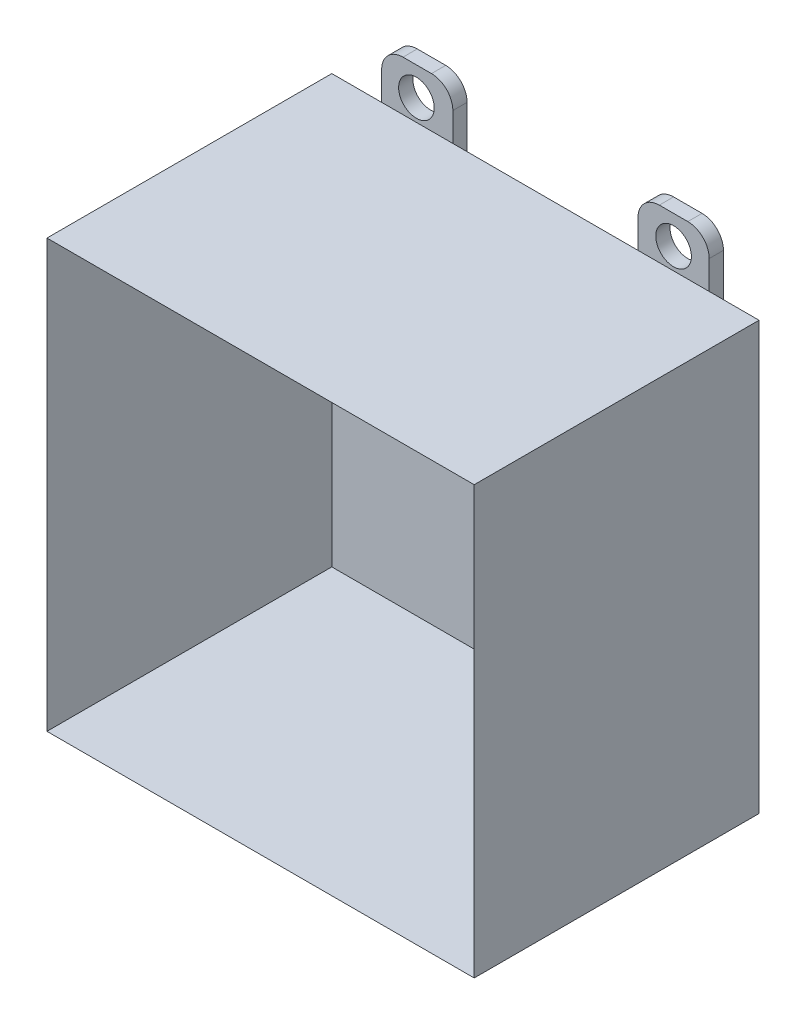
ISO-10303-21;
HEADER;
FILE_DESCRIPTION(('STEP AP214'),'2;1');
FILE_NAME('part.step','',(''),(''),'','','');
FILE_SCHEMA(('AUTOMOTIVE_DESIGN { 1 0 10303 214 1 1 1 1 }'));
ENDSEC;
DATA;
#1=APPLICATION_CONTEXT('core data for automotive mechanical design processes');
#2=APPLICATION_PROTOCOL_DEFINITION('international standard','automotive_design',2000,#1);
#3=PRODUCT_CONTEXT('',#1,'mechanical');
#4=PRODUCT('Part','Part','',(#3));
#5=PRODUCT_RELATED_PRODUCT_CATEGORY('part','',(#4));
#6=PRODUCT_DEFINITION_FORMATION('','',#4);
#7=PRODUCT_DEFINITION_CONTEXT('part definition',#1,'design');
#8=PRODUCT_DEFINITION('design','',#6,#7);
#9=PRODUCT_DEFINITION_SHAPE('','',#8);
#10=(LENGTH_UNIT() NAMED_UNIT(*) SI_UNIT(.MILLI.,.METRE.));
#11=(NAMED_UNIT(*) PLANE_ANGLE_UNIT() SI_UNIT($,.RADIAN.));
#12=(NAMED_UNIT(*) SI_UNIT($,.STERADIAN.) SOLID_ANGLE_UNIT());
#13=UNCERTAINTY_MEASURE_WITH_UNIT(LENGTH_MEASURE(1.E-05),#10,'distance_accuracy_value','');
#14=(GEOMETRIC_REPRESENTATION_CONTEXT(3) GLOBAL_UNCERTAINTY_ASSIGNED_CONTEXT((#13)) GLOBAL_UNIT_ASSIGNED_CONTEXT((#10,
#11,#12)) REPRESENTATION_CONTEXT('',''));
#15=CARTESIAN_POINT('',(0.,0.,0.));
#16=DIRECTION('',(0.,0.,1.));
#17=DIRECTION('',(1.,0.,0.));
#18=AXIS2_PLACEMENT_3D('',#15,#16,#17);
#19=CARTESIAN_POINT('',(-29.21,29.21,-2.54));
#20=DIRECTION('',(1.,0.,0.));
#21=DIRECTION('',(0.,0.,-1.));
#22=AXIS2_PLACEMENT_3D('',#19,#20,#21);
#23=PLANE('',#22);
#24=DIRECTION('',(0.,1.,0.));
#25=VECTOR('',#24,1.);
#26=CARTESIAN_POINT('',(-29.21,29.21,0.));
#27=LINE('',#26,#25);
#28=CARTESIAN_POINT('',(-29.21,29.21,0.));
#29=VERTEX_POINT('',#28);
#30=CARTESIAN_POINT('',(-29.21,43.18,0.));
#31=VERTEX_POINT('',#30);
#32=EDGE_CURVE('E132',#29,#31,#27,.T.);
#33=ORIENTED_EDGE('',*,*,#32,.T.);
#34=DIRECTION('',(0.,0.,1.));
#35=VECTOR('',#34,1.);
#36=CARTESIAN_POINT('',(-29.21,43.18,-2.54));
#37=LINE('',#36,#35);
#38=CARTESIAN_POINT('',(-29.21,43.18,-2.54));
#39=VERTEX_POINT('',#38);
#40=EDGE_CURVE('E76',#31,#39,#37,.F.);
#41=ORIENTED_EDGE('',*,*,#40,.T.);
#42=DIRECTION('',(0.,1.,0.));
#43=VECTOR('',#42,1.);
#44=CARTESIAN_POINT('',(-29.21,29.21,-2.54));
#45=LINE('',#44,#43);
#46=CARTESIAN_POINT('',(-29.21,29.21,-2.54));
#47=VERTEX_POINT('',#46);
#48=EDGE_CURVE('E140',#47,#39,#45,.T.);
#49=ORIENTED_EDGE('',*,*,#48,.F.);
#50=DIRECTION('',(0.,0.,1.));
#51=VECTOR('',#50,1.);
#52=CARTESIAN_POINT('',(-29.21,29.21,-2.54));
#53=LINE('',#52,#51);
#54=EDGE_CURVE('E124',#47,#29,#53,.T.);
#55=ORIENTED_EDGE('',*,*,#54,.T.);
#56=EDGE_LOOP('',(#33,#41,#49,#55));
#57=FACE_BOUND('',#56,.T.);
#58=ADVANCED_FACE('F53',(#57),#23,.F.);
#59=CARTESIAN_POINT('',(-16.51,46.99,-2.54));
#60=DIRECTION('',(0.,-1.,0.));
#61=DIRECTION('',(0.,0.,-1.));
#62=AXIS2_PLACEMENT_3D('',#59,#60,#61);
#63=PLANE('',#62);
#64=DIRECTION('',(1.,0.,0.));
#65=VECTOR('',#64,1.);
#66=CARTESIAN_POINT('',(-16.51,46.99,-2.54));
#67=LINE('',#66,#65);
#68=CARTESIAN_POINT('',(-25.4,46.99,-2.54));
#69=VERTEX_POINT('',#68);
#70=CARTESIAN_POINT('',(-20.32,46.99,-2.54));
#71=VERTEX_POINT('',#70);
#72=EDGE_CURVE('E114',#69,#71,#67,.T.);
#73=ORIENTED_EDGE('',*,*,#72,.F.);
#74=DIRECTION('',(0.,0.,1.));
#75=VECTOR('',#74,1.);
#76=CARTESIAN_POINT('',(-25.4,46.99,-2.54));
#77=LINE('',#76,#75);
#78=CARTESIAN_POINT('',(-25.4,46.99,0.));
#79=VERTEX_POINT('',#78);
#80=EDGE_CURVE('E143',#69,#79,#77,.T.);
#81=ORIENTED_EDGE('',*,*,#80,.T.);
#82=DIRECTION('',(1.,0.,0.));
#83=VECTOR('',#82,1.);
#84=CARTESIAN_POINT('',(-16.51,46.99,0.));
#85=LINE('',#84,#83);
#86=CARTESIAN_POINT('',(-20.32,46.99,0.));
#87=VERTEX_POINT('',#86);
#88=EDGE_CURVE('E134',#79,#87,#85,.T.);
#89=ORIENTED_EDGE('',*,*,#88,.T.);
#90=DIRECTION('',(0.,0.,1.));
#91=VECTOR('',#90,1.);
#92=CARTESIAN_POINT('',(-20.32,46.99,-2.54));
#93=LINE('',#92,#91);
#94=EDGE_CURVE('E123',#87,#71,#93,.F.);
#95=ORIENTED_EDGE('',*,*,#94,.T.);
#96=EDGE_LOOP('',(#73,#81,#89,#95));
#97=FACE_BOUND('',#96,.T.);
#98=ADVANCED_FACE('F156',(#97),#63,.F.);
#99=CARTESIAN_POINT('',(-16.51,29.21,-2.54));
#100=DIRECTION('',(-1.,0.,0.));
#101=DIRECTION('',(0.,0.,1.));
#102=AXIS2_PLACEMENT_3D('',#99,#100,#101);
#103=PLANE('',#102);
#104=DIRECTION('',(0.,-1.,0.));
#105=VECTOR('',#104,1.);
#106=CARTESIAN_POINT('',(-16.51,29.21,-2.54));
#107=LINE('',#106,#105);
#108=CARTESIAN_POINT('',(-16.51,43.18,-2.54));
#109=VERTEX_POINT('',#108);
#110=CARTESIAN_POINT('',(-16.51,29.21,-2.54));
#111=VERTEX_POINT('',#110);
#112=EDGE_CURVE('E106',#109,#111,#107,.T.);
#113=ORIENTED_EDGE('',*,*,#112,.F.);
#114=DIRECTION('',(0.,0.,1.));
#115=VECTOR('',#114,1.);
#116=CARTESIAN_POINT('',(-16.51,43.18,-2.54));
#117=LINE('',#116,#115);
#118=CARTESIAN_POINT('',(-16.51,43.18,0.));
#119=VERTEX_POINT('',#118);
#120=EDGE_CURVE('E12',#109,#119,#117,.T.);
#121=ORIENTED_EDGE('',*,*,#120,.T.);
#122=DIRECTION('',(0.,-1.,0.));
#123=VECTOR('',#122,1.);
#124=CARTESIAN_POINT('',(-16.51,29.21,0.));
#125=LINE('',#124,#123);
#126=CARTESIAN_POINT('',(-16.51,29.21,0.));
#127=VERTEX_POINT('',#126);
#128=EDGE_CURVE('E120',#119,#127,#125,.T.);
#129=ORIENTED_EDGE('',*,*,#128,.T.);
#130=DIRECTION('',(0.,0.,1.));
#131=VECTOR('',#130,1.);
#132=CARTESIAN_POINT('',(-16.51,29.21,-2.54));
#133=LINE('',#132,#131);
#134=EDGE_CURVE('E117',#111,#127,#133,.T.);
#135=ORIENTED_EDGE('',*,*,#134,.F.);
#136=EDGE_LOOP('',(#113,#121,#129,#135));
#137=FACE_BOUND('',#136,.T.);
#138=ADVANCED_FACE('F118',(#137),#103,.F.);
#139=CARTESIAN_POINT('',(-16.51,29.21,-2.54));
#140=DIRECTION('',(0.,1.,0.));
#141=DIRECTION('',(0.,0.,1.));
#142=AXIS2_PLACEMENT_3D('',#139,#140,#141);
#143=PLANE('',#142);
#144=DIRECTION('',(-1.,0.,0.));
#145=VECTOR('',#144,1.);
#146=CARTESIAN_POINT('',(-16.51,29.21,0.));
#147=LINE('',#146,#145);
#148=EDGE_CURVE('E139',#127,#29,#147,.T.);
#149=ORIENTED_EDGE('',*,*,#148,.T.);
#150=ORIENTED_EDGE('',*,*,#54,.F.);
#151=DIRECTION('',(-1.,0.,0.));
#152=VECTOR('',#151,1.);
#153=CARTESIAN_POINT('',(-16.51,29.21,-2.54));
#154=LINE('',#153,#152);
#155=EDGE_CURVE('E110',#111,#47,#154,.T.);
#156=ORIENTED_EDGE('',*,*,#155,.F.);
#157=ORIENTED_EDGE('',*,*,#134,.T.);
#158=EDGE_LOOP('',(#149,#150,#156,#157));
#159=FACE_BOUND('',#158,.T.);
#160=ADVANCED_FACE('F126',(#159),#143,.F.);
#161=CARTESIAN_POINT('',(0.,0.,-2.54));
#162=DIRECTION('',(0.,0.,1.));
#163=DIRECTION('',(1.,0.,0.));
#164=AXIS2_PLACEMENT_3D('',#161,#162,#163);
#165=PLANE('',#164);
#166=CARTESIAN_POINT('',(-23.0080853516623,41.91,-2.54));
#167=DIRECTION('',(0.,0.,1.));
#168=DIRECTION('',(1.,0.,0.));
#169=AXIS2_PLACEMENT_3D('',#166,#167,#168);
#170=CIRCLE('',#169,3.175);
#171=CARTESIAN_POINT('',(-19.8330853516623,41.91,-2.54));
#172=VERTEX_POINT('',#171);
#173=EDGE_CURVE('E135',#172,#172,#170,.T.);
#174=ORIENTED_EDGE('',*,*,#173,.T.);
#175=EDGE_LOOP('',(#174));
#176=FACE_BOUND('',#175,.T.);
#177=ORIENTED_EDGE('',*,*,#48,.T.);
#178=CARTESIAN_POINT('',(-25.4,43.18,-2.54));
#179=DIRECTION('',(0.,0.,1.));
#180=DIRECTION('',(1.,0.,0.));
#181=AXIS2_PLACEMENT_3D('',#178,#179,#180);
#182=CIRCLE('',#181,3.81);
#183=EDGE_CURVE('E61',#39,#69,#182,.F.);
#184=ORIENTED_EDGE('',*,*,#183,.T.);
#185=ORIENTED_EDGE('',*,*,#72,.T.);
#186=CARTESIAN_POINT('',(-20.32,43.18,-2.54));
#187=DIRECTION('',(0.,0.,1.));
#188=DIRECTION('',(1.,0.,0.));
#189=AXIS2_PLACEMENT_3D('',#186,#187,#188);
#190=CIRCLE('',#189,3.81);
#191=EDGE_CURVE('E68',#71,#109,#190,.F.);
#192=ORIENTED_EDGE('',*,*,#191,.T.);
#193=ORIENTED_EDGE('',*,*,#112,.T.);
#194=ORIENTED_EDGE('',*,*,#155,.T.);
#195=EDGE_LOOP('',(#177,#184,#185,#192,#193,#194));
#196=FACE_BOUND('',#195,.T.);
#197=ADVANCED_FACE('F108',(#176,#196),#165,.F.);
#198=CARTESIAN_POINT('',(0.,0.,0.));
#199=DIRECTION('',(0.,0.,1.));
#200=DIRECTION('',(1.,0.,0.));
#201=AXIS2_PLACEMENT_3D('',#198,#199,#200);
#202=PLANE('',#201);
#203=CARTESIAN_POINT('',(-23.0080853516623,41.91,0.));
#204=DIRECTION('',(0.,0.,1.));
#205=DIRECTION('',(1.,0.,0.));
#206=AXIS2_PLACEMENT_3D('',#203,#204,#205);
#207=CIRCLE('',#206,3.175);
#208=CARTESIAN_POINT('',(-19.8330853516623,41.91,0.));
#209=VERTEX_POINT('',#208);
#210=EDGE_CURVE('E165',#209,#209,#207,.T.);
#211=ORIENTED_EDGE('',*,*,#210,.F.);
#212=EDGE_LOOP('',(#211));
#213=FACE_BOUND('',#212,.T.);
#214=ORIENTED_EDGE('',*,*,#88,.F.);
#215=CARTESIAN_POINT('',(-25.4,43.18,0.));
#216=DIRECTION('',(0.,0.,1.));
#217=DIRECTION('',(1.,0.,0.));
#218=AXIS2_PLACEMENT_3D('',#215,#216,#217);
#219=CIRCLE('',#218,3.81);
#220=EDGE_CURVE('E148',#79,#31,#219,.T.);
#221=ORIENTED_EDGE('',*,*,#220,.T.);
#222=ORIENTED_EDGE('',*,*,#32,.F.);
#223=ORIENTED_EDGE('',*,*,#148,.F.);
#224=ORIENTED_EDGE('',*,*,#128,.F.);
#225=CARTESIAN_POINT('',(-20.32,43.18,0.));
#226=DIRECTION('',(0.,0.,1.));
#227=DIRECTION('',(1.,0.,0.));
#228=AXIS2_PLACEMENT_3D('',#225,#226,#227);
#229=CIRCLE('',#228,3.81);
#230=EDGE_CURVE('E146',#119,#87,#229,.T.);
#231=ORIENTED_EDGE('',*,*,#230,.T.);
#232=EDGE_LOOP('',(#214,#221,#222,#223,#224,#231));
#233=FACE_BOUND('',#232,.T.);
#234=ADVANCED_FACE('F162',(#213,#233),#202,.T.);
#235=CARTESIAN_POINT('',(-23.0080853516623,41.91,-2.54));
#236=DIRECTION('',(0.,0.,1.));
#237=DIRECTION('',(1.,0.,0.));
#238=AXIS2_PLACEMENT_3D('',#235,#236,#237);
#239=CYLINDRICAL_SURFACE('',#238,3.175);
#240=ORIENTED_EDGE('',*,*,#173,.F.);
#241=EDGE_LOOP('',(#240));
#242=FACE_BOUND('',#241,.T.);
#243=ORIENTED_EDGE('',*,*,#210,.T.);
#244=EDGE_LOOP('',(#243));
#245=FACE_BOUND('',#244,.T.);
#246=ADVANCED_FACE('F172',(#242,#245),#239,.F.);
#247=CARTESIAN_POINT('',(-25.4,43.18,-2.54));
#248=DIRECTION('',(0.,0.,1.));
#249=DIRECTION('',(1.,0.,0.));
#250=AXIS2_PLACEMENT_3D('',#247,#248,#249);
#251=CYLINDRICAL_SURFACE('',#250,3.81);
#252=ORIENTED_EDGE('',*,*,#183,.F.);
#253=ORIENTED_EDGE('',*,*,#40,.F.);
#254=ORIENTED_EDGE('',*,*,#220,.F.);
#255=ORIENTED_EDGE('',*,*,#80,.F.);
#256=EDGE_LOOP('',(#252,#253,#254,#255));
#257=FACE_BOUND('',#256,.T.);
#258=ADVANCED_FACE('F159',(#257),#251,.T.);
#259=CARTESIAN_POINT('',(-20.32,43.18,-2.54));
#260=DIRECTION('',(0.,0.,1.));
#261=DIRECTION('',(1.,0.,0.));
#262=AXIS2_PLACEMENT_3D('',#259,#260,#261);
#263=CYLINDRICAL_SURFACE('',#262,3.81);
#264=ORIENTED_EDGE('',*,*,#191,.F.);
#265=ORIENTED_EDGE('',*,*,#94,.F.);
#266=ORIENTED_EDGE('',*,*,#230,.F.);
#267=ORIENTED_EDGE('',*,*,#120,.F.);
#268=EDGE_LOOP('',(#264,#265,#266,#267));
#269=FACE_BOUND('',#268,.T.);
#270=ADVANCED_FACE('F55',(#269),#263,.T.);
#271=CLOSED_SHELL('',(#58,#98,#138,#160,#197,#234,#246,#258,#270));
#272=MANIFOLD_SOLID_BREP('B2',#271);
#273=CARTESIAN_POINT('',(16.51,46.99,-2.54));
#274=DIRECTION('',(1.,0.,0.));
#275=DIRECTION('',(0.,1.,0.));
#276=AXIS2_PLACEMENT_3D('',#273,#274,#275);
#277=PLANE('',#276);
#278=DIRECTION('',(0.,1.,0.));
#279=VECTOR('',#278,1.);
#280=CARTESIAN_POINT('',(16.51,46.99,0.));
#281=LINE('',#280,#279);
#282=CARTESIAN_POINT('',(16.51,29.21,0.));
#283=VERTEX_POINT('',#282);
#284=CARTESIAN_POINT('',(16.51,43.18,0.));
#285=VERTEX_POINT('',#284);
#286=EDGE_CURVE('E337',#283,#285,#281,.T.);
#287=ORIENTED_EDGE('',*,*,#286,.T.);
#288=DIRECTION('',(0.,0.,1.));
#289=VECTOR('',#288,1.);
#290=CARTESIAN_POINT('',(16.51,43.18,-2.54));
#291=LINE('',#290,#289);
#292=CARTESIAN_POINT('',(16.51,43.18,-2.54));
#293=VERTEX_POINT('',#292);
#294=EDGE_CURVE('E281',#285,#293,#291,.F.);
#295=ORIENTED_EDGE('',*,*,#294,.T.);
#296=DIRECTION('',(0.,1.,0.));
#297=VECTOR('',#296,1.);
#298=CARTESIAN_POINT('',(16.51,46.99,-2.54));
#299=LINE('',#298,#297);
#300=CARTESIAN_POINT('',(16.51,29.21,-2.54));
#301=VERTEX_POINT('',#300);
#302=EDGE_CURVE('E345',#301,#293,#299,.T.);
#303=ORIENTED_EDGE('',*,*,#302,.F.);
#304=DIRECTION('',(0.,0.,1.));
#305=VECTOR('',#304,1.);
#306=CARTESIAN_POINT('',(16.51,29.21,-2.54));
#307=LINE('',#306,#305);
#308=EDGE_CURVE('E329',#301,#283,#307,.T.);
#309=ORIENTED_EDGE('',*,*,#308,.T.);
#310=EDGE_LOOP('',(#287,#295,#303,#309));
#311=FACE_BOUND('',#310,.T.);
#312=ADVANCED_FACE('F258',(#311),#277,.F.);
#313=CARTESIAN_POINT('',(29.21,46.99,-2.54));
#314=DIRECTION('',(0.,-1.,0.));
#315=DIRECTION('',(0.,0.,-1.));
#316=AXIS2_PLACEMENT_3D('',#313,#314,#315);
#317=PLANE('',#316);
#318=DIRECTION('',(1.,0.,0.));
#319=VECTOR('',#318,1.);
#320=CARTESIAN_POINT('',(29.21,46.99,-2.54));
#321=LINE('',#320,#319);
#322=CARTESIAN_POINT('',(20.32,46.99,-2.54));
#323=VERTEX_POINT('',#322);
#324=CARTESIAN_POINT('',(25.4,46.99,-2.54));
#325=VERTEX_POINT('',#324);
#326=EDGE_CURVE('E319',#323,#325,#321,.T.);
#327=ORIENTED_EDGE('',*,*,#326,.F.);
#328=DIRECTION('',(0.,0.,1.));
#329=VECTOR('',#328,1.);
#330=CARTESIAN_POINT('',(20.32,46.99,-2.54));
#331=LINE('',#330,#329);
#332=CARTESIAN_POINT('',(20.32,46.99,0.));
#333=VERTEX_POINT('',#332);
#334=EDGE_CURVE('E348',#323,#333,#331,.T.);
#335=ORIENTED_EDGE('',*,*,#334,.T.);
#336=DIRECTION('',(1.,0.,0.));
#337=VECTOR('',#336,1.);
#338=CARTESIAN_POINT('',(29.21,46.99,0.));
#339=LINE('',#338,#337);
#340=CARTESIAN_POINT('',(25.4,46.99,0.));
#341=VERTEX_POINT('',#340);
#342=EDGE_CURVE('E339',#333,#341,#339,.T.);
#343=ORIENTED_EDGE('',*,*,#342,.T.);
#344=DIRECTION('',(0.,0.,1.));
#345=VECTOR('',#344,1.);
#346=CARTESIAN_POINT('',(25.4,46.99,-2.54));
#347=LINE('',#346,#345);
#348=EDGE_CURVE('E328',#341,#325,#347,.F.);
#349=ORIENTED_EDGE('',*,*,#348,.T.);
#350=EDGE_LOOP('',(#327,#335,#343,#349));
#351=FACE_BOUND('',#350,.T.);
#352=ADVANCED_FACE('F361',(#351),#317,.F.);
#353=CARTESIAN_POINT('',(29.21,46.99,-2.54));
#354=DIRECTION('',(-1.,0.,0.));
#355=DIRECTION('',(0.,-1.,0.));
#356=AXIS2_PLACEMENT_3D('',#353,#354,#355);
#357=PLANE('',#356);
#358=DIRECTION('',(0.,-1.,0.));
#359=VECTOR('',#358,1.);
#360=CARTESIAN_POINT('',(29.21,46.99,-2.54));
#361=LINE('',#360,#359);
#362=CARTESIAN_POINT('',(29.21,43.18,-2.54));
#363=VERTEX_POINT('',#362);
#364=CARTESIAN_POINT('',(29.21,29.21,-2.54));
#365=VERTEX_POINT('',#364);
#366=EDGE_CURVE('E311',#363,#365,#361,.T.);
#367=ORIENTED_EDGE('',*,*,#366,.F.);
#368=DIRECTION('',(0.,0.,1.));
#369=VECTOR('',#368,1.);
#370=CARTESIAN_POINT('',(29.21,43.18,-2.54));
#371=LINE('',#370,#369);
#372=CARTESIAN_POINT('',(29.21,43.18,0.));
#373=VERTEX_POINT('',#372);
#374=EDGE_CURVE('E51',#363,#373,#371,.T.);
#375=ORIENTED_EDGE('',*,*,#374,.T.);
#376=DIRECTION('',(0.,-1.,0.));
#377=VECTOR('',#376,1.);
#378=CARTESIAN_POINT('',(29.21,46.99,0.));
#379=LINE('',#378,#377);
#380=CARTESIAN_POINT('',(29.21,29.21,0.));
#381=VERTEX_POINT('',#380);
#382=EDGE_CURVE('E325',#373,#381,#379,.T.);
#383=ORIENTED_EDGE('',*,*,#382,.T.);
#384=DIRECTION('',(0.,0.,1.));
#385=VECTOR('',#384,1.);
#386=CARTESIAN_POINT('',(29.21,29.21,-2.54));
#387=LINE('',#386,#385);
#388=EDGE_CURVE('E322',#365,#381,#387,.T.);
#389=ORIENTED_EDGE('',*,*,#388,.F.);
#390=EDGE_LOOP('',(#367,#375,#383,#389));
#391=FACE_BOUND('',#390,.T.);
#392=ADVANCED_FACE('F323',(#391),#357,.F.);
#393=CARTESIAN_POINT('',(29.21,29.21,-2.54));
#394=DIRECTION('',(0.,1.,0.));
#395=DIRECTION('',(0.,0.,1.));
#396=AXIS2_PLACEMENT_3D('',#393,#394,#395);
#397=PLANE('',#396);
#398=DIRECTION('',(-1.,0.,0.));
#399=VECTOR('',#398,1.);
#400=CARTESIAN_POINT('',(29.21,29.21,0.));
#401=LINE('',#400,#399);
#402=EDGE_CURVE('E344',#381,#283,#401,.T.);
#403=ORIENTED_EDGE('',*,*,#402,.T.);
#404=ORIENTED_EDGE('',*,*,#308,.F.);
#405=DIRECTION('',(-1.,0.,0.));
#406=VECTOR('',#405,1.);
#407=CARTESIAN_POINT('',(29.21,29.21,-2.54));
#408=LINE('',#407,#406);
#409=EDGE_CURVE('E315',#365,#301,#408,.T.);
#410=ORIENTED_EDGE('',*,*,#409,.F.);
#411=ORIENTED_EDGE('',*,*,#388,.T.);
#412=EDGE_LOOP('',(#403,#404,#410,#411));
#413=FACE_BOUND('',#412,.T.);
#414=ADVANCED_FACE('F331',(#413),#397,.F.);
#415=CARTESIAN_POINT('',(0.,0.,-2.54));
#416=DIRECTION('',(0.,0.,-1.));
#417=DIRECTION('',(-1.,0.,0.));
#418=AXIS2_PLACEMENT_3D('',#415,#416,#417);
#419=PLANE('',#418);
#420=CARTESIAN_POINT('',(22.86,41.91,-2.54));
#421=DIRECTION('',(0.,0.,1.));
#422=DIRECTION('',(1.,0.,0.));
#423=AXIS2_PLACEMENT_3D('',#420,#421,#422);
#424=CIRCLE('',#423,3.175);
#425=CARTESIAN_POINT('',(26.035,41.91,-2.54));
#426=VERTEX_POINT('',#425);
#427=EDGE_CURVE('E340',#426,#426,#424,.T.);
#428=ORIENTED_EDGE('',*,*,#427,.T.);
#429=EDGE_LOOP('',(#428));
#430=FACE_BOUND('',#429,.T.);
#431=ORIENTED_EDGE('',*,*,#302,.T.);
#432=CARTESIAN_POINT('',(20.32,43.18,-2.54));
#433=DIRECTION('',(0.,0.,-1.));
#434=DIRECTION('',(-1.,0.,0.));
#435=AXIS2_PLACEMENT_3D('',#432,#433,#434);
#436=CIRCLE('',#435,3.81);
#437=EDGE_CURVE('E266',#293,#323,#436,.T.);
#438=ORIENTED_EDGE('',*,*,#437,.T.);
#439=ORIENTED_EDGE('',*,*,#326,.T.);
#440=CARTESIAN_POINT('',(25.4,43.18,-2.54));
#441=DIRECTION('',(0.,0.,-1.));
#442=DIRECTION('',(-1.,0.,0.));
#443=AXIS2_PLACEMENT_3D('',#440,#441,#442);
#444=CIRCLE('',#443,3.81);
#445=EDGE_CURVE('E273',#325,#363,#444,.T.);
#446=ORIENTED_EDGE('',*,*,#445,.T.);
#447=ORIENTED_EDGE('',*,*,#366,.T.);
#448=ORIENTED_EDGE('',*,*,#409,.T.);
#449=EDGE_LOOP('',(#431,#438,#439,#446,#447,#448));
#450=FACE_BOUND('',#449,.T.);
#451=ADVANCED_FACE('F313',(#430,#450),#419,.T.);
#452=CARTESIAN_POINT('',(0.,0.,0.));
#453=DIRECTION('',(0.,0.,-1.));
#454=DIRECTION('',(-1.,0.,0.));
#455=AXIS2_PLACEMENT_3D('',#452,#453,#454);
#456=PLANE('',#455);
#457=CARTESIAN_POINT('',(22.86,41.91,0.));
#458=DIRECTION('',(0.,0.,1.));
#459=DIRECTION('',(1.,0.,0.));
#460=AXIS2_PLACEMENT_3D('',#457,#458,#459);
#461=CIRCLE('',#460,3.175);
#462=CARTESIAN_POINT('',(26.035,41.91,0.));
#463=VERTEX_POINT('',#462);
#464=EDGE_CURVE('E370',#463,#463,#461,.T.);
#465=ORIENTED_EDGE('',*,*,#464,.F.);
#466=EDGE_LOOP('',(#465));
#467=FACE_BOUND('',#466,.T.);
#468=ORIENTED_EDGE('',*,*,#342,.F.);
#469=CARTESIAN_POINT('',(20.32,43.18,0.));
#470=DIRECTION('',(0.,0.,-1.));
#471=DIRECTION('',(-1.,0.,0.));
#472=AXIS2_PLACEMENT_3D('',#469,#470,#471);
#473=CIRCLE('',#472,3.81);
#474=EDGE_CURVE('E353',#333,#285,#473,.F.);
#475=ORIENTED_EDGE('',*,*,#474,.T.);
#476=ORIENTED_EDGE('',*,*,#286,.F.);
#477=ORIENTED_EDGE('',*,*,#402,.F.);
#478=ORIENTED_EDGE('',*,*,#382,.F.);
#479=CARTESIAN_POINT('',(25.4,43.18,0.));
#480=DIRECTION('',(0.,0.,-1.));
#481=DIRECTION('',(-1.,0.,0.));
#482=AXIS2_PLACEMENT_3D('',#479,#480,#481);
#483=CIRCLE('',#482,3.81);
#484=EDGE_CURVE('E351',#373,#341,#483,.F.);
#485=ORIENTED_EDGE('',*,*,#484,.T.);
#486=EDGE_LOOP('',(#468,#475,#476,#477,#478,#485));
#487=FACE_BOUND('',#486,.T.);
#488=ADVANCED_FACE('F367',(#467,#487),#456,.F.);
#489=CARTESIAN_POINT('',(22.86,41.91,-2.54));
#490=DIRECTION('',(0.,0.,1.));
#491=DIRECTION('',(1.,0.,0.));
#492=AXIS2_PLACEMENT_3D('',#489,#490,#491);
#493=CYLINDRICAL_SURFACE('',#492,3.175);
#494=ORIENTED_EDGE('',*,*,#427,.F.);
#495=EDGE_LOOP('',(#494));
#496=FACE_BOUND('',#495,.T.);
#497=ORIENTED_EDGE('',*,*,#464,.T.);
#498=EDGE_LOOP('',(#497));
#499=FACE_BOUND('',#498,.T.);
#500=ADVANCED_FACE('F377',(#496,#499),#493,.F.);
#501=CARTESIAN_POINT('',(20.32,43.18,-2.54));
#502=DIRECTION('',(0.,0.,1.));
#503=DIRECTION('',(1.,0.,0.));
#504=AXIS2_PLACEMENT_3D('',#501,#502,#503);
#505=CYLINDRICAL_SURFACE('',#504,3.81);
#506=ORIENTED_EDGE('',*,*,#437,.F.);
#507=ORIENTED_EDGE('',*,*,#294,.F.);
#508=ORIENTED_EDGE('',*,*,#474,.F.);
#509=ORIENTED_EDGE('',*,*,#334,.F.);
#510=EDGE_LOOP('',(#506,#507,#508,#509));
#511=FACE_BOUND('',#510,.T.);
#512=ADVANCED_FACE('F364',(#511),#505,.T.);
#513=CARTESIAN_POINT('',(25.4,43.18,-2.54));
#514=DIRECTION('',(0.,0.,1.));
#515=DIRECTION('',(1.,0.,0.));
#516=AXIS2_PLACEMENT_3D('',#513,#514,#515);
#517=CYLINDRICAL_SURFACE('',#516,3.81);
#518=ORIENTED_EDGE('',*,*,#445,.F.);
#519=ORIENTED_EDGE('',*,*,#348,.F.);
#520=ORIENTED_EDGE('',*,*,#484,.F.);
#521=ORIENTED_EDGE('',*,*,#374,.F.);
#522=EDGE_LOOP('',(#518,#519,#520,#521));
#523=FACE_BOUND('',#522,.T.);
#524=ADVANCED_FACE('F260',(#523),#517,.T.);
#525=CLOSED_SHELL('',(#312,#352,#392,#414,#451,#488,#500,#512,#524));
#526=MANIFOLD_SOLID_BREP('B6',#525);
#527=CARTESIAN_POINT('',(38.1,-38.1,50.8));
#528=DIRECTION('',(-1.,0.,0.));
#529=DIRECTION('',(0.,0.,1.));
#530=AXIS2_PLACEMENT_3D('',#527,#528,#529);
#531=PLANE('',#530);
#532=DIRECTION('',(0.,1.,0.));
#533=VECTOR('',#532,1.);
#534=CARTESIAN_POINT('',(38.1,-38.1,0.));
#535=LINE('',#534,#533);
#536=CARTESIAN_POINT('',(38.1,-38.1,0.));
#537=VERTEX_POINT('',#536);
#538=CARTESIAN_POINT('',(38.1,38.1,0.));
#539=VERTEX_POINT('',#538);
#540=EDGE_CURVE('E517',#537,#539,#535,.T.);
#541=ORIENTED_EDGE('',*,*,#540,.T.);
#542=DIRECTION('',(0.,0.,-1.));
#543=VECTOR('',#542,1.);
#544=CARTESIAN_POINT('',(38.1,38.1,50.8));
#545=LINE('',#544,#543);
#546=CARTESIAN_POINT('',(38.1,38.1,50.8));
#547=VERTEX_POINT('',#546);
#548=EDGE_CURVE('E256',#547,#539,#545,.T.);
#549=ORIENTED_EDGE('',*,*,#548,.F.);
#550=DIRECTION('',(0.,1.,0.));
#551=VECTOR('',#550,1.);
#552=CARTESIAN_POINT('',(38.1,-38.1,50.8));
#553=LINE('',#552,#551);
#554=CARTESIAN_POINT('',(38.1,-38.1,50.8));
#555=VERTEX_POINT('',#554);
#556=EDGE_CURVE('E506',#555,#547,#553,.T.);
#557=ORIENTED_EDGE('',*,*,#556,.F.);
#558=DIRECTION('',(0.,0.,-1.));
#559=VECTOR('',#558,1.);
#560=CARTESIAN_POINT('',(38.1,-38.1,50.8));
#561=LINE('',#560,#559);
#562=EDGE_CURVE('E510',#555,#537,#561,.T.);
#563=ORIENTED_EDGE('',*,*,#562,.T.);
#564=EDGE_LOOP('',(#541,#549,#557,#563));
#565=FACE_BOUND('',#564,.T.);
#566=ADVANCED_FACE('F454',(#565),#531,.F.);
#567=CARTESIAN_POINT('',(-38.1,38.1,50.8));
#568=DIRECTION('',(0.,-1.,0.));
#569=DIRECTION('',(0.,0.,-1.));
#570=AXIS2_PLACEMENT_3D('',#567,#568,#569);
#571=PLANE('',#570);
#572=DIRECTION('',(-1.,0.,0.));
#573=VECTOR('',#572,1.);
#574=CARTESIAN_POINT('',(-38.1,38.1,0.));
#575=LINE('',#574,#573);
#576=CARTESIAN_POINT('',(-38.1,38.1,0.));
#577=VERTEX_POINT('',#576);
#578=EDGE_CURVE('E509',#539,#577,#575,.T.);
#579=ORIENTED_EDGE('',*,*,#578,.T.);
#580=DIRECTION('',(0.,0.,-1.));
#581=VECTOR('',#580,1.);
#582=CARTESIAN_POINT('',(-38.1,38.1,50.8));
#583=LINE('',#582,#581);
#584=CARTESIAN_POINT('',(-38.1,38.1,50.8));
#585=VERTEX_POINT('',#584);
#586=EDGE_CURVE('E460',#585,#577,#583,.T.);
#587=ORIENTED_EDGE('',*,*,#586,.F.);
#588=DIRECTION('',(-1.,0.,0.));
#589=VECTOR('',#588,1.);
#590=CARTESIAN_POINT('',(-38.1,38.1,50.8));
#591=LINE('',#590,#589);
#592=EDGE_CURVE('E496',#547,#585,#591,.T.);
#593=ORIENTED_EDGE('',*,*,#592,.F.);
#594=ORIENTED_EDGE('',*,*,#548,.T.);
#595=EDGE_LOOP('',(#579,#587,#593,#594));
#596=FACE_BOUND('',#595,.T.);
#597=ADVANCED_FACE('F508',(#596),#571,.F.);
#598=CARTESIAN_POINT('',(-38.1,-38.1,50.8));
#599=DIRECTION('',(1.,0.,0.));
#600=DIRECTION('',(0.,0.,-1.));
#601=AXIS2_PLACEMENT_3D('',#598,#599,#600);
#602=PLANE('',#601);
#603=DIRECTION('',(0.,-1.,0.));
#604=VECTOR('',#603,1.);
#605=CARTESIAN_POINT('',(-38.1,-38.1,0.));
#606=LINE('',#605,#604);
#607=CARTESIAN_POINT('',(-38.1,-38.1,0.));
#608=VERTEX_POINT('',#607);
#609=EDGE_CURVE('E482',#577,#608,#606,.T.);
#610=ORIENTED_EDGE('',*,*,#609,.T.);
#611=DIRECTION('',(0.,0.,-1.));
#612=VECTOR('',#611,1.);
#613=CARTESIAN_POINT('',(-38.1,-38.1,50.8));
#614=LINE('',#613,#612);
#615=CARTESIAN_POINT('',(-38.1,-38.1,50.8));
#616=VERTEX_POINT('',#615);
#617=EDGE_CURVE('E502',#616,#608,#614,.T.);
#618=ORIENTED_EDGE('',*,*,#617,.F.);
#619=DIRECTION('',(0.,-1.,0.));
#620=VECTOR('',#619,1.);
#621=CARTESIAN_POINT('',(-38.1,-38.1,50.8));
#622=LINE('',#621,#620);
#623=EDGE_CURVE('E500',#585,#616,#622,.T.);
#624=ORIENTED_EDGE('',*,*,#623,.F.);
#625=ORIENTED_EDGE('',*,*,#586,.T.);
#626=EDGE_LOOP('',(#610,#618,#624,#625));
#627=FACE_BOUND('',#626,.T.);
#628=ADVANCED_FACE('F501',(#627),#602,.F.);
#629=CARTESIAN_POINT('',(-38.1,-38.1,50.8));
#630=DIRECTION('',(0.,1.,0.));
#631=DIRECTION('',(0.,0.,1.));
#632=AXIS2_PLACEMENT_3D('',#629,#630,#631);
#633=PLANE('',#632);
#634=DIRECTION('',(1.,0.,0.));
#635=VECTOR('',#634,1.);
#636=CARTESIAN_POINT('',(-38.1,-38.1,0.));
#637=LINE('',#636,#635);
#638=EDGE_CURVE('E489',#608,#537,#637,.T.);
#639=ORIENTED_EDGE('',*,*,#638,.T.);
#640=ORIENTED_EDGE('',*,*,#562,.F.);
#641=DIRECTION('',(1.,0.,0.));
#642=VECTOR('',#641,1.);
#643=CARTESIAN_POINT('',(-38.1,-38.1,50.8));
#644=LINE('',#643,#642);
#645=EDGE_CURVE('E465',#616,#555,#644,.T.);
#646=ORIENTED_EDGE('',*,*,#645,.F.);
#647=ORIENTED_EDGE('',*,*,#617,.T.);
#648=EDGE_LOOP('',(#639,#640,#646,#647));
#649=FACE_BOUND('',#648,.T.);
#650=ADVANCED_FACE('F531',(#649),#633,.F.);
#651=CARTESIAN_POINT('',(0.,0.,0.));
#652=DIRECTION('',(0.,0.,-1.));
#653=DIRECTION('',(-1.,0.,0.));
#654=AXIS2_PLACEMENT_3D('',#651,#652,#653);
#655=PLANE('',#654);
#656=ORIENTED_EDGE('',*,*,#540,.F.);
#657=ORIENTED_EDGE('',*,*,#638,.F.);
#658=ORIENTED_EDGE('',*,*,#609,.F.);
#659=ORIENTED_EDGE('',*,*,#578,.F.);
#660=EDGE_LOOP('',(#656,#657,#658,#659));
#661=FACE_BOUND('',#660,.T.);
#662=ADVANCED_FACE('F529',(#661),#655,.T.);
#663=OPEN_SHELL('',(#566,#597,#628,#650,#662));
#664=SHELL_BASED_SURFACE_MODEL('B45',(#663));
#665=ADVANCED_BREP_SHAPE_REPRESENTATION('',(#18,#272,#526),#14);
#666=MANIFOLD_SURFACE_SHAPE_REPRESENTATION('',(#18,#664),#14);
#667=SHAPE_REPRESENTATION('',(#18),#14);
#668=SHAPE_DEFINITION_REPRESENTATION(#9,#667);
#669=SHAPE_REPRESENTATION_RELATIONSHIP('','',#667,#665);
#670=SHAPE_REPRESENTATION_RELATIONSHIP('','',#667,#666);
ENDSEC;
END-ISO-10303-21;
